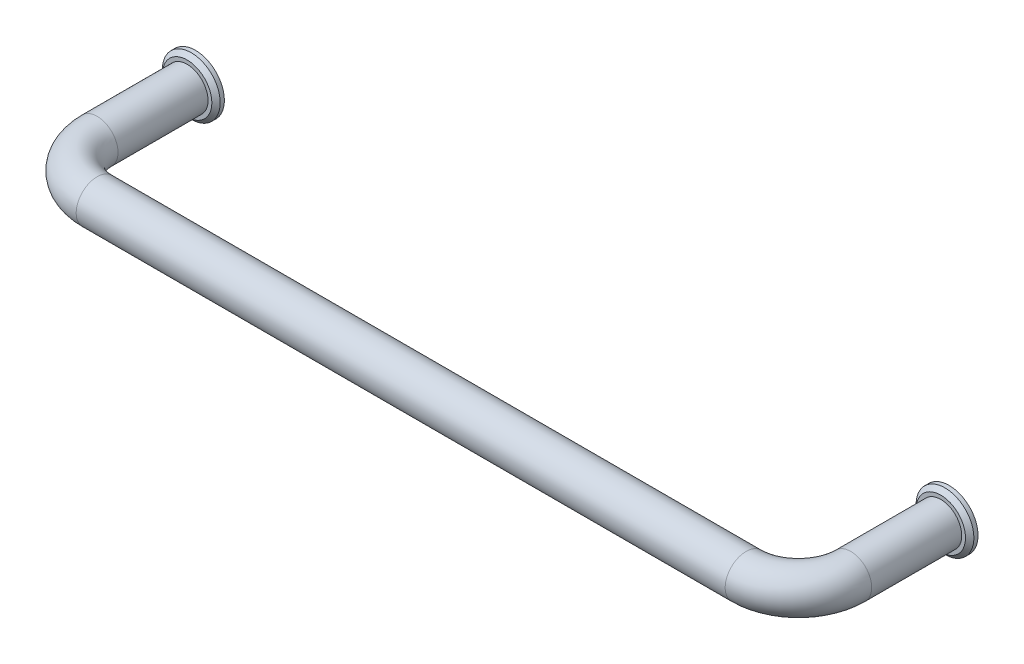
ISO-10303-21;
HEADER;
FILE_DESCRIPTION(('STEP AP214'),'2;1');
FILE_NAME('part.step','',(''),(''),'','','');
FILE_SCHEMA(('AUTOMOTIVE_DESIGN { 1 0 10303 214 1 1 1 1 }'));
ENDSEC;
DATA;
#1=APPLICATION_CONTEXT('core data for automotive mechanical design processes');
#2=APPLICATION_PROTOCOL_DEFINITION('international standard','automotive_design',2000,#1);
#3=PRODUCT_CONTEXT('',#1,'mechanical');
#4=PRODUCT('Part','Part','',(#3));
#5=PRODUCT_RELATED_PRODUCT_CATEGORY('part','',(#4));
#6=PRODUCT_DEFINITION_FORMATION('','',#4);
#7=PRODUCT_DEFINITION_CONTEXT('part definition',#1,'design');
#8=PRODUCT_DEFINITION('design','',#6,#7);
#9=PRODUCT_DEFINITION_SHAPE('','',#8);
#10=(LENGTH_UNIT() NAMED_UNIT(*) SI_UNIT(.MILLI.,.METRE.));
#11=(NAMED_UNIT(*) PLANE_ANGLE_UNIT() SI_UNIT($,.RADIAN.));
#12=(NAMED_UNIT(*) SI_UNIT($,.STERADIAN.) SOLID_ANGLE_UNIT());
#13=UNCERTAINTY_MEASURE_WITH_UNIT(LENGTH_MEASURE(1.E-05),#10,'distance_accuracy_value','');
#14=(GEOMETRIC_REPRESENTATION_CONTEXT(3) GLOBAL_UNCERTAINTY_ASSIGNED_CONTEXT((#13)) GLOBAL_UNIT_ASSIGNED_CONTEXT((#10,
#11,#12)) REPRESENTATION_CONTEXT('',''));
#15=CARTESIAN_POINT('',(0.,0.,0.));
#16=DIRECTION('',(0.,0.,1.));
#17=DIRECTION('',(1.,0.,0.));
#18=AXIS2_PLACEMENT_3D('',#15,#16,#17);
#19=CARTESIAN_POINT('',(0.,0.,0.));
#20=DIRECTION('',(0.,0.,1.));
#21=DIRECTION('',(0.,1.,0.));
#22=AXIS2_PLACEMENT_3D('',#19,#20,#21);
#23=PLANE('',#22);
#24=CARTESIAN_POINT('',(0.,0.,0.));
#25=DIRECTION('',(0.,0.,1.));
#26=DIRECTION('',(1.,0.,0.));
#27=AXIS2_PLACEMENT_3D('',#24,#25,#26);
#28=CIRCLE('',#27,6.9);
#29=CARTESIAN_POINT('',(6.9,0.,0.));
#30=VERTEX_POINT('',#29);
#31=EDGE_CURVE('E30',#30,#30,#28,.T.);
#32=ORIENTED_EDGE('',*,*,#31,.F.);
#33=EDGE_LOOP('',(#32));
#34=FACE_BOUND('',#33,.T.);
#35=CARTESIAN_POINT('',(0.,0.,0.));
#36=DIRECTION('',(0.,0.,1.));
#37=DIRECTION('',(0.,1.,0.));
#38=AXIS2_PLACEMENT_3D('',#35,#36,#37);
#39=CIRCLE('',#38,2.5);
#40=CARTESIAN_POINT('',(0.,2.5,0.));
#41=VERTEX_POINT('',#40);
#42=EDGE_CURVE('E16',#41,#41,#39,.F.);
#43=ORIENTED_EDGE('',*,*,#42,.F.);
#44=EDGE_LOOP('',(#43));
#45=FACE_BOUND('',#44,.T.);
#46=ADVANCED_FACE('F12',(#34,#45),#23,.F.);
#47=CARTESIAN_POINT('',(0.,0.,23.5));
#48=DIRECTION('',(0.,0.,-1.));
#49=DIRECTION('',(-1.,0.,0.));
#50=AXIS2_PLACEMENT_3D('',#47,#48,#49);
#51=CYLINDRICAL_SURFACE('',#50,5.);
#52=CARTESIAN_POINT('',(0.,0.,23.5));
#53=DIRECTION('',(0.,0.,1.));
#54=DIRECTION('',(0.,1.,0.));
#55=AXIS2_PLACEMENT_3D('',#52,#53,#54);
#56=CIRCLE('',#55,5.);
#57=CARTESIAN_POINT('',(-5.,0.,23.5));
#58=VERTEX_POINT('',#57);
#59=EDGE_CURVE('E51',#58,#58,#56,.T.);
#60=ORIENTED_EDGE('',*,*,#59,.F.);
#61=EDGE_LOOP('',(#60));
#62=FACE_BOUND('',#61,.T.);
#63=CARTESIAN_POINT('',(0.,0.,2.00000000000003));
#64=DIRECTION('',(0.,0.,-1.));
#65=DIRECTION('',(-1.,0.,0.));
#66=AXIS2_PLACEMENT_3D('',#63,#64,#65);
#67=CIRCLE('',#66,5.);
#68=CARTESIAN_POINT('',(-5.,0.,2.00000000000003));
#69=VERTEX_POINT('',#68);
#70=EDGE_CURVE('E25',#69,#69,#67,.T.);
#71=ORIENTED_EDGE('',*,*,#70,.F.);
#72=EDGE_LOOP('',(#71));
#73=FACE_BOUND('',#72,.T.);
#74=ADVANCED_FACE('F75',(#62,#73),#51,.T.);
#75=CARTESIAN_POINT('',(180.,0.,23.5));
#76=DIRECTION('',(0.,0.,-1.));
#77=DIRECTION('',(-1.,0.,0.));
#78=AXIS2_PLACEMENT_3D('',#75,#76,#77);
#79=CYLINDRICAL_SURFACE('',#78,5.);
#80=CARTESIAN_POINT('',(180.,0.,23.5));
#81=DIRECTION('',(0.,0.,-1.));
#82=DIRECTION('',(0.,1.,0.));
#83=AXIS2_PLACEMENT_3D('',#80,#81,#82);
#84=CIRCLE('',#83,5.);
#85=CARTESIAN_POINT('',(185.,0.,23.5));
#86=VERTEX_POINT('',#85);
#87=EDGE_CURVE('E60',#86,#86,#84,.T.);
#88=ORIENTED_EDGE('',*,*,#87,.T.);
#89=EDGE_LOOP('',(#88));
#90=FACE_BOUND('',#89,.T.);
#91=CARTESIAN_POINT('',(180.,0.,1.99999999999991));
#92=DIRECTION('',(0.,0.,-1.));
#93=DIRECTION('',(-1.,0.,0.));
#94=AXIS2_PLACEMENT_3D('',#91,#92,#93);
#95=CIRCLE('',#94,5.);
#96=CARTESIAN_POINT('',(175.,0.,1.99999999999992));
#97=VERTEX_POINT('',#96);
#98=EDGE_CURVE('E50',#97,#97,#95,.F.);
#99=ORIENTED_EDGE('',*,*,#98,.T.);
#100=EDGE_LOOP('',(#99));
#101=FACE_BOUND('',#100,.T.);
#102=ADVANCED_FACE('F14',(#90,#101),#79,.T.);
#103=CARTESIAN_POINT('',(167.5,0.,23.5));
#104=DIRECTION('',(0.,1.,0.));
#105=DIRECTION('',(-1.,0.,0.));
#106=AXIS2_PLACEMENT_3D('',#103,#104,#105);
#107=TOROIDAL_SURFACE('',#106,12.5,5.);
#108=CARTESIAN_POINT('',(167.5,0.,36.));
#109=DIRECTION('',(1.,0.,0.));
#110=DIRECTION('',(0.,1.,0.));
#111=AXIS2_PLACEMENT_3D('',#108,#109,#110);
#112=CIRCLE('',#111,5.);
#113=CARTESIAN_POINT('',(167.5,0.,41.));
#114=VERTEX_POINT('',#113);
#115=EDGE_CURVE('E57',#114,#114,#112,.T.);
#116=CARTESIAN_POINT('',(167.5,0.,23.5));
#117=DIRECTION('',(0.,1.,0.));
#118=DIRECTION('',(-1.,0.,0.));
#119=AXIS2_PLACEMENT_3D('',#116,#117,#118);
#120=CIRCLE('',#119,17.5);
#121=EDGE_CURVE('',#114,#86,#120,.T.);
#122=ORIENTED_EDGE('',*,*,#115,.T.);
#123=ORIENTED_EDGE('',*,*,#87,.F.);
#124=ORIENTED_EDGE('',*,*,#121,.T.);
#125=ORIENTED_EDGE('',*,*,#121,.F.);
#126=EDGE_LOOP('',(#122,#124,#123,#125));
#127=FACE_BOUND('',#126,.T.);
#128=ADVANCED_FACE('F85',(#127),#107,.T.);
#129=CARTESIAN_POINT('',(12.5,0.,36.));
#130=DIRECTION('',(1.,0.,0.));
#131=DIRECTION('',(0.,0.,-1.));
#132=AXIS2_PLACEMENT_3D('',#129,#130,#131);
#133=CYLINDRICAL_SURFACE('',#132,5.);
#134=CARTESIAN_POINT('',(12.5,0.,36.));
#135=DIRECTION('',(1.,0.,0.));
#136=DIRECTION('',(0.,1.,0.));
#137=AXIS2_PLACEMENT_3D('',#134,#135,#136);
#138=CIRCLE('',#137,5.);
#139=CARTESIAN_POINT('',(12.5,0.,41.));
#140=VERTEX_POINT('',#139);
#141=EDGE_CURVE('E54',#140,#140,#138,.T.);
#142=ORIENTED_EDGE('',*,*,#141,.T.);
#143=EDGE_LOOP('',(#142));
#144=FACE_BOUND('',#143,.T.);
#145=ORIENTED_EDGE('',*,*,#115,.F.);
#146=EDGE_LOOP('',(#145));
#147=FACE_BOUND('',#146,.T.);
#148=ADVANCED_FACE('F97',(#144,#147),#133,.T.);
#149=CARTESIAN_POINT('',(12.5,0.,23.5));
#150=DIRECTION('',(0.,1.,0.));
#151=DIRECTION('',(-1.,0.,0.));
#152=AXIS2_PLACEMENT_3D('',#149,#150,#151);
#153=TOROIDAL_SURFACE('',#152,12.5,5.);
#154=CARTESIAN_POINT('',(12.5,0.,23.5));
#155=DIRECTION('',(0.,1.,0.));
#156=DIRECTION('',(-1.,0.,0.));
#157=AXIS2_PLACEMENT_3D('',#154,#155,#156);
#158=CIRCLE('',#157,17.5);
#159=EDGE_CURVE('',#58,#140,#158,.T.);
#160=ORIENTED_EDGE('',*,*,#59,.T.);
#161=ORIENTED_EDGE('',*,*,#141,.F.);
#162=ORIENTED_EDGE('',*,*,#159,.T.);
#163=ORIENTED_EDGE('',*,*,#159,.F.);
#164=EDGE_LOOP('',(#160,#162,#161,#163));
#165=FACE_BOUND('',#164,.T.);
#166=ADVANCED_FACE('F93',(#165),#153,.T.);
#167=CARTESIAN_POINT('',(180.,0.,1.99999999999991));
#168=DIRECTION('',(0.,0.,-1.));
#169=DIRECTION('',(-1.,0.,0.));
#170=AXIS2_PLACEMENT_3D('',#167,#168,#169);
#171=CYLINDRICAL_SURFACE('',#170,6.9);
#172=CARTESIAN_POINT('',(180.,0.,0.999999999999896));
#173=DIRECTION('',(0.,0.,-1.));
#174=DIRECTION('',(0.,-1.,0.));
#175=AXIS2_PLACEMENT_3D('',#172,#173,#174);
#176=CIRCLE('',#175,6.9);
#177=CARTESIAN_POINT('',(180.,-6.9,0.999999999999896));
#178=VERTEX_POINT('',#177);
#179=EDGE_CURVE('E63',#178,#178,#176,.T.);
#180=ORIENTED_EDGE('',*,*,#179,.T.);
#181=EDGE_LOOP('',(#180));
#182=FACE_BOUND('',#181,.T.);
#183=CARTESIAN_POINT('',(180.,0.,0.));
#184=DIRECTION('',(0.,0.,-1.));
#185=DIRECTION('',(-1.,0.,0.));
#186=AXIS2_PLACEMENT_3D('',#183,#184,#185);
#187=CIRCLE('',#186,6.9);
#188=CARTESIAN_POINT('',(173.1,0.,0.));
#189=VERTEX_POINT('',#188);
#190=EDGE_CURVE('E34',#189,#189,#187,.T.);
#191=ORIENTED_EDGE('',*,*,#190,.F.);
#192=EDGE_LOOP('',(#191));
#193=FACE_BOUND('',#192,.T.);
#194=ADVANCED_FACE('F96',(#182,#193),#171,.T.);
#195=CARTESIAN_POINT('',(180.,0.,1.99999999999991));
#196=DIRECTION('',(0.,0.,-1.));
#197=DIRECTION('',(-1.,0.,0.));
#198=AXIS2_PLACEMENT_3D('',#195,#196,#197);
#199=PLANE('',#198);
#200=CARTESIAN_POINT('',(180.,0.,1.99999999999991));
#201=DIRECTION('',(0.,0.,-1.));
#202=DIRECTION('',(-1.,0.,0.));
#203=AXIS2_PLACEMENT_3D('',#200,#201,#202);
#204=CIRCLE('',#203,5.9);
#205=CARTESIAN_POINT('',(174.1,0.,1.99999999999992));
#206=VERTEX_POINT('',#205);
#207=EDGE_CURVE('E68',#206,#206,#204,.F.);
#208=ORIENTED_EDGE('',*,*,#207,.T.);
#209=EDGE_LOOP('',(#208));
#210=FACE_BOUND('',#209,.T.);
#211=ORIENTED_EDGE('',*,*,#98,.F.);
#212=EDGE_LOOP('',(#211));
#213=FACE_BOUND('',#212,.T.);
#214=ADVANCED_FACE('F112',(#210,#213),#199,.F.);
#215=CARTESIAN_POINT('',(180.,0.,-1.47411153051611E-13));
#216=DIRECTION('',(0.,0.,-1.));
#217=DIRECTION('',(0.,1.,0.));
#218=AXIS2_PLACEMENT_3D('',#215,#216,#217);
#219=PLANE('',#218);
#220=CARTESIAN_POINT('',(180.,0.,-1.47411153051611E-13));
#221=DIRECTION('',(0.,0.,-1.));
#222=DIRECTION('',(-1.,0.,0.));
#223=AXIS2_PLACEMENT_3D('',#220,#221,#222);
#224=CIRCLE('',#223,2.5);
#225=CARTESIAN_POINT('',(177.5,0.,-1.46658719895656E-13));
#226=VERTEX_POINT('',#225);
#227=EDGE_CURVE('E28',#226,#226,#224,.T.);
#228=ORIENTED_EDGE('',*,*,#227,.F.);
#229=EDGE_LOOP('',(#228));
#230=FACE_BOUND('',#229,.T.);
#231=ORIENTED_EDGE('',*,*,#190,.T.);
#232=EDGE_LOOP('',(#231));
#233=FACE_BOUND('',#232,.T.);
#234=ADVANCED_FACE('F92',(#230,#233),#219,.T.);
#235=CARTESIAN_POINT('',(180.,0.,0.999999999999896));
#236=DIRECTION('',(0.,0.,-1.));
#237=DIRECTION('',(0.,-1.,0.));
#238=AXIS2_PLACEMENT_3D('',#235,#236,#237);
#239=CONICAL_SURFACE('',#238,6.9,0.785398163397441);
#240=ORIENTED_EDGE('',*,*,#207,.F.);
#241=EDGE_LOOP('',(#240));
#242=FACE_BOUND('',#241,.T.);
#243=ORIENTED_EDGE('',*,*,#179,.F.);
#244=EDGE_LOOP('',(#243));
#245=FACE_BOUND('',#244,.T.);
#246=ADVANCED_FACE('F121',(#242,#245),#239,.T.);
#247=CARTESIAN_POINT('',(0.,0.,2.00000000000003));
#248=DIRECTION('',(0.,0.,-1.));
#249=DIRECTION('',(1.,0.,0.));
#250=AXIS2_PLACEMENT_3D('',#247,#248,#249);
#251=PLANE('',#250);
#252=CARTESIAN_POINT('',(0.,0.,2.00000000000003));
#253=DIRECTION('',(0.,0.,-1.));
#254=DIRECTION('',(-1.,0.,0.));
#255=AXIS2_PLACEMENT_3D('',#252,#253,#254);
#256=CIRCLE('',#255,5.9);
#257=CARTESIAN_POINT('',(-5.9,0.,2.00000000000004));
#258=VERTEX_POINT('',#257);
#259=EDGE_CURVE('E20',#258,#258,#256,.F.);
#260=ORIENTED_EDGE('',*,*,#259,.T.);
#261=EDGE_LOOP('',(#260));
#262=FACE_BOUND('',#261,.T.);
#263=ORIENTED_EDGE('',*,*,#70,.T.);
#264=EDGE_LOOP('',(#263));
#265=FACE_BOUND('',#264,.T.);
#266=ADVANCED_FACE('F73',(#262,#265),#251,.F.);
#267=CARTESIAN_POINT('',(0.,0.,2.00000000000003));
#268=DIRECTION('',(0.,0.,-1.));
#269=DIRECTION('',(-1.,0.,0.));
#270=AXIS2_PLACEMENT_3D('',#267,#268,#269);
#271=CYLINDRICAL_SURFACE('',#270,6.9);
#272=CARTESIAN_POINT('',(0.,0.,1.00000000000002));
#273=DIRECTION('',(0.,0.,-1.));
#274=DIRECTION('',(0.,-1.,0.));
#275=AXIS2_PLACEMENT_3D('',#272,#273,#274);
#276=CIRCLE('',#275,6.9);
#277=CARTESIAN_POINT('',(0.,-6.9,1.00000000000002));
#278=VERTEX_POINT('',#277);
#279=EDGE_CURVE('E8',#278,#278,#276,.T.);
#280=ORIENTED_EDGE('',*,*,#279,.T.);
#281=EDGE_LOOP('',(#280));
#282=FACE_BOUND('',#281,.T.);
#283=ORIENTED_EDGE('',*,*,#31,.T.);
#284=EDGE_LOOP('',(#283));
#285=FACE_BOUND('',#284,.T.);
#286=ADVANCED_FACE('F129',(#282,#285),#271,.T.);
#287=CARTESIAN_POINT('',(0.,0.,2.00000000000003));
#288=DIRECTION('',(0.,0.,-1.));
#289=DIRECTION('',(0.,-1.,0.));
#290=AXIS2_PLACEMENT_3D('',#287,#288,#289);
#291=CONICAL_SURFACE('',#290,5.9,0.785398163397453);
#292=ORIENTED_EDGE('',*,*,#279,.F.);
#293=EDGE_LOOP('',(#292));
#294=FACE_BOUND('',#293,.T.);
#295=ORIENTED_EDGE('',*,*,#259,.F.);
#296=EDGE_LOOP('',(#295));
#297=FACE_BOUND('',#296,.T.);
#298=ADVANCED_FACE('F132',(#294,#297),#291,.T.);
#299=CARTESIAN_POINT('',(180.,0.,-8.00000000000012));
#300=DIRECTION('',(0.,0.,1.));
#301=DIRECTION('',(1.,0.,0.));
#302=AXIS2_PLACEMENT_3D('',#299,#300,#301);
#303=CYLINDRICAL_SURFACE('',#302,2.5);
#304=ORIENTED_EDGE('',*,*,#227,.T.);
#305=EDGE_LOOP('',(#304));
#306=FACE_BOUND('',#305,.T.);
#307=CARTESIAN_POINT('',(180.,0.,10.9999999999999));
#308=DIRECTION('',(0.,0.,-1.));
#309=DIRECTION('',(-1.,0.,0.));
#310=AXIS2_PLACEMENT_3D('',#307,#308,#309);
#311=CIRCLE('',#310,2.5);
#312=CARTESIAN_POINT('',(177.5,0.,10.9999999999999));
#313=VERTEX_POINT('',#312);
#314=EDGE_CURVE('E41',#313,#313,#311,.T.);
#315=ORIENTED_EDGE('',*,*,#314,.F.);
#316=EDGE_LOOP('',(#315));
#317=FACE_BOUND('',#316,.T.);
#318=ADVANCED_FACE('F138',(#306,#317),#303,.F.);
#319=CARTESIAN_POINT('',(0.,0.,-8.));
#320=DIRECTION('',(0.,0.,1.));
#321=DIRECTION('',(1.,0.,0.));
#322=AXIS2_PLACEMENT_3D('',#319,#320,#321);
#323=CYLINDRICAL_SURFACE('',#322,2.5);
#324=ORIENTED_EDGE('',*,*,#42,.T.);
#325=EDGE_LOOP('',(#324));
#326=FACE_BOUND('',#325,.T.);
#327=CARTESIAN_POINT('',(0.,0.,11.));
#328=DIRECTION('',(0.,0.,-1.));
#329=DIRECTION('',(-1.,0.,0.));
#330=AXIS2_PLACEMENT_3D('',#327,#328,#329);
#331=CIRCLE('',#330,2.5);
#332=CARTESIAN_POINT('',(-2.49999999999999,0.,11.));
#333=VERTEX_POINT('',#332);
#334=EDGE_CURVE('E37',#333,#333,#331,.T.);
#335=ORIENTED_EDGE('',*,*,#334,.F.);
#336=EDGE_LOOP('',(#335));
#337=FACE_BOUND('',#336,.T.);
#338=ADVANCED_FACE('F142',(#326,#337),#323,.F.);
#339=CARTESIAN_POINT('',(0.,0.,11.));
#340=DIRECTION('',(0.,0.,-1.));
#341=DIRECTION('',(-1.,0.,0.));
#342=AXIS2_PLACEMENT_3D('',#339,#340,#341);
#343=PLANE('',#342);
#344=ORIENTED_EDGE('',*,*,#334,.T.);
#345=EDGE_LOOP('',(#344));
#346=FACE_BOUND('',#345,.T.);
#347=ADVANCED_FACE('F145',(#346),#343,.T.);
#348=CARTESIAN_POINT('',(180.,0.,10.9999999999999));
#349=DIRECTION('',(0.,0.,-1.));
#350=DIRECTION('',(-1.,0.,0.));
#351=AXIS2_PLACEMENT_3D('',#348,#349,#350);
#352=PLANE('',#351);
#353=ORIENTED_EDGE('',*,*,#314,.T.);
#354=EDGE_LOOP('',(#353));
#355=FACE_BOUND('',#354,.T.);
#356=ADVANCED_FACE('F148',(#355),#352,.T.);
#357=CLOSED_SHELL('',(#46,#74,#102,#128,#148,#166,#194,#214,#234,#246,#266,#286,#298,#318,#338,
#347,#356));
#358=MANIFOLD_SOLID_BREP('B1',#357);
#359=ADVANCED_BREP_SHAPE_REPRESENTATION('',(#18,#358),#14);
#360=SHAPE_DEFINITION_REPRESENTATION(#9,#359);
ENDSEC;
END-ISO-10303-21;
